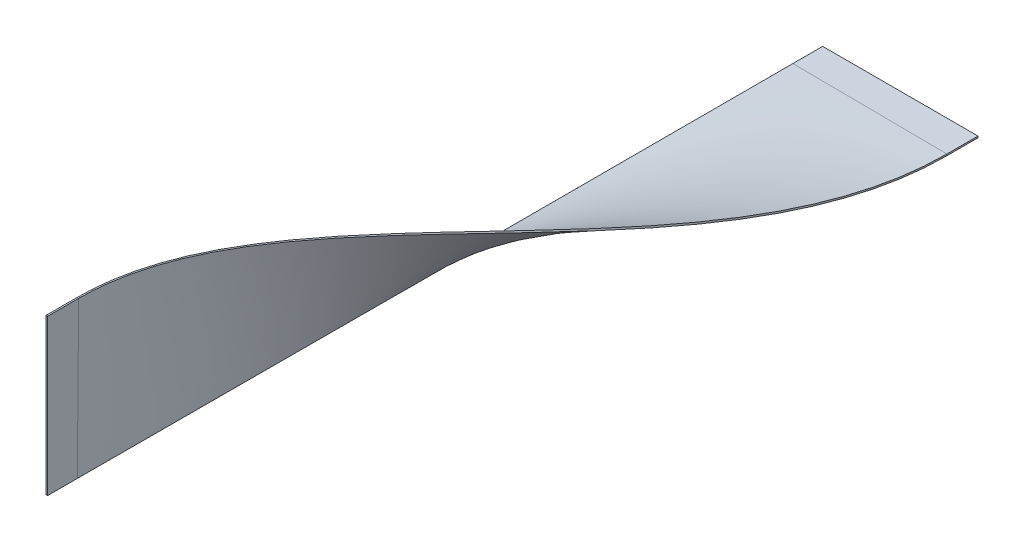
ISO-10303-21;
HEADER;
FILE_DESCRIPTION(('STEP AP214'),'2;1');
FILE_NAME('part.step','',(''),(''),'','','');
FILE_SCHEMA(('AUTOMOTIVE_DESIGN { 1 0 10303 214 1 1 1 1 }'));
ENDSEC;
DATA;
#1=APPLICATION_CONTEXT('core data for automotive mechanical design processes');
#2=APPLICATION_PROTOCOL_DEFINITION('international standard','automotive_design',2000,#1);
#3=PRODUCT_CONTEXT('',#1,'mechanical');
#4=PRODUCT('Part','Part','',(#3));
#5=PRODUCT_RELATED_PRODUCT_CATEGORY('part','',(#4));
#6=PRODUCT_DEFINITION_FORMATION('','',#4);
#7=PRODUCT_DEFINITION_CONTEXT('part definition',#1,'design');
#8=PRODUCT_DEFINITION('design','',#6,#7);
#9=PRODUCT_DEFINITION_SHAPE('','',#8);
#10=(LENGTH_UNIT() NAMED_UNIT(*) SI_UNIT(.MILLI.,.METRE.));
#11=(NAMED_UNIT(*) PLANE_ANGLE_UNIT() SI_UNIT($,.RADIAN.));
#12=(NAMED_UNIT(*) SI_UNIT($,.STERADIAN.) SOLID_ANGLE_UNIT());
#13=UNCERTAINTY_MEASURE_WITH_UNIT(LENGTH_MEASURE(1.E-05),#10,'distance_accuracy_value','');
#14=(GEOMETRIC_REPRESENTATION_CONTEXT(3) GLOBAL_UNCERTAINTY_ASSIGNED_CONTEXT((#13)) GLOBAL_UNIT_ASSIGNED_CONTEXT((#10,
#11,#12)) REPRESENTATION_CONTEXT('',''));
#15=CARTESIAN_POINT('',(0.,0.,0.));
#16=DIRECTION('',(0.,0.,1.));
#17=DIRECTION('',(1.,0.,0.));
#18=AXIS2_PLACEMENT_3D('',#15,#16,#17);
#19=CARTESIAN_POINT('',(0.,0.,0.));
#20=DIRECTION('',(0.,-1.,0.));
#21=DIRECTION('',(0.,0.,1.));
#22=AXIS2_PLACEMENT_3D('',#19,#20,#21);
#23=PLANE('',#22);
#24=DIRECTION('',(1.,0.,0.));
#25=VECTOR('',#24,1.);
#26=CARTESIAN_POINT('',(0.,0.,500.));
#27=LINE('',#26,#25);
#28=CARTESIAN_POINT('',(0.,0.,500.));
#29=VERTEX_POINT('',#28);
#30=CARTESIAN_POINT('',(1.00000000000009,0.,500.));
#31=VERTEX_POINT('',#30);
#32=EDGE_CURVE('E14',#29,#31,#27,.T.);
#33=ORIENTED_EDGE('',*,*,#32,.F.);
#34=DIRECTION('',(0.,0.,1.));
#35=VECTOR('',#34,1.);
#36=CARTESIAN_POINT('',(0.,0.,0.));
#37=LINE('',#36,#35);
#38=CARTESIAN_POINT('',(0.,0.,480.815287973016));
#39=VERTEX_POINT('',#38);
#40=EDGE_CURVE('E391',#39,#29,#37,.T.);
#41=ORIENTED_EDGE('',*,*,#40,.F.);
#42=CARTESIAN_POINT('',(1.00000000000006,0.,480.815287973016));
#43=CARTESIAN_POINT('',(0.,0.,480.815287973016));
#44=B_SPLINE_CURVE_WITH_KNOTS('',1,(#42,#43),.UNSPECIFIED.,.F.,.F.,(2,2),(0.,1.),.UNSPECIFIED.);
#45=CARTESIAN_POINT('',(1.00000000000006,0.,480.815287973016));
#46=VERTEX_POINT('',#45);
#47=EDGE_CURVE('E69',#39,#46,#44,.F.);
#48=ORIENTED_EDGE('',*,*,#47,.T.);
#49=DIRECTION('',(0.,0.,1.));
#50=VECTOR('',#49,1.);
#51=CARTESIAN_POINT('',(1.00000000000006,0.,480.));
#52=LINE('',#51,#50);
#53=EDGE_CURVE('E382',#46,#31,#52,.T.);
#54=ORIENTED_EDGE('',*,*,#53,.T.);
#55=EDGE_LOOP('',(#33,#41,#48,#54));
#56=FACE_BOUND('',#55,.T.);
#57=ADVANCED_FACE('F59',(#56),#23,.T.);
#58=CARTESIAN_POINT('',(1.00000000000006,0.,480.815287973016));
#59=CARTESIAN_POINT('',(1.00000000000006,0.,461.580680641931));
#60=CARTESIAN_POINT('',(1.00032995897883,-0.0150885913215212,442.346073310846));
#61=CARTESIAN_POINT('',(0.997657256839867,-0.0746169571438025,403.876858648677));
#62=CARTESIAN_POINT('',(0.994873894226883,-0.119493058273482,384.642251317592));
#63=CARTESIAN_POINT('',(0.971690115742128,-0.244685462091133,346.173036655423));
#64=CARTESIAN_POINT('',(0.950879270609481,-0.32633143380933,326.938429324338));
#65=CARTESIAN_POINT('',(0.885815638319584,-0.466901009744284,298.086518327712));
#66=CARTESIAN_POINT('',(0.858393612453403,-0.516425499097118,288.469214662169));
#67=CARTESIAN_POINT('',(0.791154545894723,-0.614499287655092,269.234607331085));
#68=CARTESIAN_POINT('',(0.751300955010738,-0.662912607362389,259.617303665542));
#69=CARTESIAN_POINT('',(0.662912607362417,-0.751300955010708,240.382696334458));
#70=CARTESIAN_POINT('',(0.614499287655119,-0.791154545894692,230.765392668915));
#71=CARTESIAN_POINT('',(0.516425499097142,-0.858393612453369,211.530785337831));
#72=CARTESIAN_POINT('',(0.466901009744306,-0.885815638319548,201.913481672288));
#73=CARTESIAN_POINT('',(0.326331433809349,-0.950879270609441,173.061570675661));
#74=CARTESIAN_POINT('',(0.24468546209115,-0.971690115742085,153.826963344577));
#75=CARTESIAN_POINT('',(0.119493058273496,-0.994873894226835,115.357748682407));
#76=CARTESIAN_POINT('',(0.0746169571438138,-0.997657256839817,96.1231413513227));
#77=CARTESIAN_POINT('',(0.0150885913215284,-1.00032995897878,57.6539266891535));
#78=CARTESIAN_POINT('',(0.,-1.,38.4193193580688));
#79=CARTESIAN_POINT('',(0.,-1.,19.1847120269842));
#80=CARTESIAN_POINT('',(0.,0.,480.815287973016));
#81=CARTESIAN_POINT('',(0.,0.,461.580680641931));
#82=CARTESIAN_POINT('',(0.,0.,442.346073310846));
#83=CARTESIAN_POINT('',(0.,0.,403.876858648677));
#84=CARTESIAN_POINT('',(0.,0.,384.642251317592));
#85=CARTESIAN_POINT('',(0.,0.,346.173036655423));
#86=CARTESIAN_POINT('',(0.,0.,326.938429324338));
#87=CARTESIAN_POINT('',(0.,0.,298.086518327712));
#88=CARTESIAN_POINT('',(0.,0.,288.469214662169));
#89=CARTESIAN_POINT('',(0.,0.,269.234607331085));
#90=CARTESIAN_POINT('',(0.,0.,259.617303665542));
#91=CARTESIAN_POINT('',(0.,0.,240.382696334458));
#92=CARTESIAN_POINT('',(0.,0.,230.765392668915));
#93=CARTESIAN_POINT('',(0.,0.,211.530785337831));
#94=CARTESIAN_POINT('',(0.,0.,201.913481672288));
#95=CARTESIAN_POINT('',(0.,0.,173.061570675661));
#96=CARTESIAN_POINT('',(0.,0.,153.826963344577));
#97=CARTESIAN_POINT('',(0.,0.,115.357748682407));
#98=CARTESIAN_POINT('',(0.,0.,96.1231413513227));
#99=CARTESIAN_POINT('',(0.,0.,57.6539266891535));
#100=CARTESIAN_POINT('',(0.,0.,38.4193193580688));
#101=CARTESIAN_POINT('',(0.,0.,19.1847120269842));
#102=B_SPLINE_SURFACE_WITH_KNOTS('',1,3,((#58,#59,#60,#61,#62,#63,#64,#65,#66,#67,#68,#69,#70,
#71,#72,#73,#74,#75,#76,#77,#78,#79),(#80,#81,#82,#83,#84,#85,#86,#87,#88,#89,#90,#91,#92,#93,
#94,#95,#96,#97,#98,#99,#100,#101)),.UNSPECIFIED.,.F.,.F.,.F.,(2,2),(4,2,2,2,2,2,2,2,2,2,4),(0.,
1.),(-0.230815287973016,-0.173111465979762,-0.115407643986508,-0.0577038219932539,
-0.028851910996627,0.,0.028851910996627,0.0577038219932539,0.115407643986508,0.173111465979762,
0.230815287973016),.UNSPECIFIED.);
#103=CARTESIAN_POINT('',(0.,0.,480.815287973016));
#104=CARTESIAN_POINT('',(0.,0.,461.580680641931));
#105=CARTESIAN_POINT('',(0.,0.,442.346073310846));
#106=CARTESIAN_POINT('',(0.,0.,403.876858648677));
#107=CARTESIAN_POINT('',(0.,0.,384.642251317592));
#108=CARTESIAN_POINT('',(0.,0.,346.173036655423));
#109=CARTESIAN_POINT('',(0.,0.,326.938429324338));
#110=CARTESIAN_POINT('',(0.,0.,298.086518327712));
#111=CARTESIAN_POINT('',(0.,0.,288.469214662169));
#112=CARTESIAN_POINT('',(0.,0.,269.234607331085));
#113=CARTESIAN_POINT('',(0.,0.,259.617303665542));
#114=CARTESIAN_POINT('',(0.,0.,240.382696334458));
#115=CARTESIAN_POINT('',(0.,0.,230.765392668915));
#116=CARTESIAN_POINT('',(0.,0.,211.530785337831));
#117=CARTESIAN_POINT('',(0.,0.,201.913481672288));
#118=CARTESIAN_POINT('',(0.,0.,173.061570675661));
#119=CARTESIAN_POINT('',(0.,0.,153.826963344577));
#120=CARTESIAN_POINT('',(0.,0.,115.357748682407));
#121=CARTESIAN_POINT('',(0.,0.,96.1231413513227));
#122=CARTESIAN_POINT('',(0.,0.,57.6539266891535));
#123=CARTESIAN_POINT('',(0.,0.,38.4193193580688));
#124=CARTESIAN_POINT('',(0.,0.,19.1847120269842));
#125=B_SPLINE_CURVE_WITH_KNOTS('',3,(#103,#104,#105,#106,#107,#108,#109,#110,#111,#112,#113,
#114,#115,#116,#117,#118,#119,#120,#121,#122,#123,#124),.UNSPECIFIED.,.F.,.F.,(4,2,2,2,2,2,2,2,
2,2,4),(-0.230815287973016,-0.173111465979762,-0.115407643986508,-0.0577038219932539,
-0.028851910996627,0.,0.028851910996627,0.0577038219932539,0.115407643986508,0.173111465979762,
0.230815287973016),.UNSPECIFIED.);
#126=CARTESIAN_POINT('',(0.,0.,19.1847120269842));
#127=VERTEX_POINT('',#126);
#128=EDGE_CURVE('E158',#39,#127,#125,.T.);
#129=CARTESIAN_POINT('',(0.,0.,19.1847120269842));
#130=CARTESIAN_POINT('',(0.,-1.,19.1847120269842));
#131=B_SPLINE_CURVE_WITH_KNOTS('',1,(#129,#130),.UNSPECIFIED.,.F.,.F.,(2,2),(0.,1.),.UNSPECIFIED.);
#132=CARTESIAN_POINT('',(0.,-1.,19.1847120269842));
#133=VERTEX_POINT('',#132);
#134=EDGE_CURVE('E303',#127,#133,#131,.T.);
#135=CARTESIAN_POINT('',(1.00000000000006,0.,480.815287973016));
#136=CARTESIAN_POINT('',(0.999911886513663,-0.000134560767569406,471.197983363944));
#137=CARTESIAN_POINT('',(0.999996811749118,-0.0039010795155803,461.580678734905));
#138=CARTESIAN_POINT('',(0.999874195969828,-0.0188135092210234,442.346069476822));
#139=CARTESIAN_POINT('',(0.999666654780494,-0.0299594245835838,432.728764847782));
#140=CARTESIAN_POINT('',(0.998320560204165,-0.0597461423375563,413.494155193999));
#141=CARTESIAN_POINT('',(0.997182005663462,-0.078386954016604,403.876850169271));
#142=CARTESIAN_POINT('',(0.992561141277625,-0.123905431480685,384.642239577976));
#143=CARTESIAN_POINT('',(0.989078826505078,-0.150783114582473,375.02493401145));
#144=CARTESIAN_POINT('',(0.977485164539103,-0.213395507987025,355.790322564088));
#145=CARTESIAN_POINT('',(0.969373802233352,-0.249130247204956,346.173016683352));
#146=CARTESIAN_POINT('',(0.945237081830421,-0.329026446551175,326.938405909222));
#147=CARTESIAN_POINT('',(0.92921168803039,-0.373187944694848,317.321101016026));
#148=CARTESIAN_POINT('',(0.885795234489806,-0.466901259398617,298.086494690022));
#149=CARTESIAN_POINT('',(0.858404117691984,-0.516453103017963,288.469193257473));
#150=CARTESIAN_POINT('',(0.791143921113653,-0.614471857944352,269.234594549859));
#151=CARTESIAN_POINT('',(0.751274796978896,-0.662938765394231,259.617297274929));
#152=CARTESIAN_POINT('',(0.662938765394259,-0.751274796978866,240.382702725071));
#153=CARTESIAN_POINT('',(0.614471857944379,-0.791143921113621,230.765405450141));
#154=CARTESIAN_POINT('',(0.516453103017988,-0.858404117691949,211.530806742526));
#155=CARTESIAN_POINT('',(0.46690125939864,-0.88579523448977,201.913505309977));
#156=CARTESIAN_POINT('',(0.373187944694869,-0.929211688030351,182.678898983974));
#157=CARTESIAN_POINT('',(0.329026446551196,-0.945237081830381,173.061594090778));
#158=CARTESIAN_POINT('',(0.249130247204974,-0.96937380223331,153.826983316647));
#159=CARTESIAN_POINT('',(0.213395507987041,-0.977485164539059,144.209677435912));
#160=CARTESIAN_POINT('',(0.150783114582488,-0.989078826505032,124.97506598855));
#161=CARTESIAN_POINT('',(0.123905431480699,-0.992561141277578,115.357760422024));
#162=CARTESIAN_POINT('',(0.0783869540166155,-0.997182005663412,96.1231498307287));
#163=CARTESIAN_POINT('',(0.0597461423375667,-0.998320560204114,86.5058448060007));
#164=CARTESIAN_POINT('',(0.0299594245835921,-0.999666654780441,67.2712351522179));
#165=CARTESIAN_POINT('',(0.0188135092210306,-0.999874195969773,57.6539305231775));
#166=CARTESIAN_POINT('',(0.00390107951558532,-0.999996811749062,38.4193212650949));
#167=CARTESIAN_POINT('',(0.000134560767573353,-0.999911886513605,28.8020166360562));
#168=CARTESIAN_POINT('',(0.,-1.,19.1847120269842));
#169=B_SPLINE_CURVE_WITH_KNOTS('',3,(#135,#136,#137,#138,#139,#140,#141,#142,#143,#144,#145,
#146,#147,#148,#149,#150,#151,#152,#153,#154,#155,#156,#157,#158,#159,#160,#161,#162,#163,#164,
#165,#166,#167,#168),.UNSPECIFIED.,.F.,.F.,(4,2,2,2,2,2,2,2,2,2,2,2,2,2,2,2,4),(0.,
28.8519132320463,57.7038436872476,86.5558098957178,115.407836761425,144.259957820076,
173.112209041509,201.964605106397,230.817103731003,259.66960235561,288.521998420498,
317.374249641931,346.226370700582,375.078397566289,403.930363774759,432.782294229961,
461.634207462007),.UNSPECIFIED.);
#170=EDGE_CURVE('E379',#46,#133,#169,.T.);
#171=ORIENTED_EDGE('',*,*,#47,.F.);
#172=ORIENTED_EDGE('',*,*,#128,.T.);
#173=ORIENTED_EDGE('',*,*,#134,.T.);
#174=ORIENTED_EDGE('',*,*,#170,.F.);
#175=EDGE_LOOP('',(#171,#172,#173,#174));
#176=FACE_BOUND('',#175,.T.);
#177=ADVANCED_FACE('F314',(#176),#102,.T.);
#178=CARTESIAN_POINT('',(0.,0.,0.));
#179=DIRECTION('',(-1.,0.,0.));
#180=DIRECTION('',(0.,0.,1.));
#181=AXIS2_PLACEMENT_3D('',#178,#179,#180);
#182=PLANE('',#181);
#183=ORIENTED_EDGE('',*,*,#134,.F.);
#184=DIRECTION('',(0.,0.,1.));
#185=VECTOR('',#184,1.);
#186=CARTESIAN_POINT('',(0.,0.,0.));
#187=LINE('',#186,#185);
#188=CARTESIAN_POINT('',(0.,0.,0.));
#189=VERTEX_POINT('',#188);
#190=EDGE_CURVE('E145',#189,#127,#187,.T.);
#191=ORIENTED_EDGE('',*,*,#190,.F.);
#192=DIRECTION('',(0.,-1.,0.));
#193=VECTOR('',#192,1.);
#194=CARTESIAN_POINT('',(0.,0.,0.));
#195=LINE('',#194,#193);
#196=CARTESIAN_POINT('',(0.,-1.,0.));
#197=VERTEX_POINT('',#196);
#198=EDGE_CURVE('E121',#189,#197,#195,.T.);
#199=ORIENTED_EDGE('',*,*,#198,.T.);
#200=DIRECTION('',(0.,0.,1.));
#201=VECTOR('',#200,1.);
#202=CARTESIAN_POINT('',(0.,-1.,0.));
#203=LINE('',#202,#201);
#204=EDGE_CURVE('E369',#197,#133,#203,.T.);
#205=ORIENTED_EDGE('',*,*,#204,.T.);
#206=EDGE_LOOP('',(#183,#191,#199,#205));
#207=FACE_BOUND('',#206,.T.);
#208=ADVANCED_FACE('F325',(#207),#182,.T.);
#209=CARTESIAN_POINT('',(0.,0.,0.));
#210=DIRECTION('',(0.,0.,1.));
#211=DIRECTION('',(1.,0.,0.));
#212=AXIS2_PLACEMENT_3D('',#209,#210,#211);
#213=PLANE('',#212);
#214=ORIENTED_EDGE('',*,*,#198,.F.);
#215=DIRECTION('',(1.,0.,0.));
#216=VECTOR('',#215,1.);
#217=CARTESIAN_POINT('',(0.,0.,0.));
#218=LINE('',#217,#216);
#219=CARTESIAN_POINT('',(100.,0.,0.));
#220=VERTEX_POINT('',#219);
#221=EDGE_CURVE('E140',#189,#220,#218,.T.);
#222=ORIENTED_EDGE('',*,*,#221,.T.);
#223=DIRECTION('',(0.,-1.,0.));
#224=VECTOR('',#223,1.);
#225=CARTESIAN_POINT('',(100.,0.,0.));
#226=LINE('',#225,#224);
#227=CARTESIAN_POINT('',(100.,-1.,0.));
#228=VERTEX_POINT('',#227);
#229=EDGE_CURVE('E127',#220,#228,#226,.T.);
#230=ORIENTED_EDGE('',*,*,#229,.T.);
#231=DIRECTION('',(1.,0.,0.));
#232=VECTOR('',#231,1.);
#233=CARTESIAN_POINT('',(100.,-1.,0.));
#234=LINE('',#233,#232);
#235=EDGE_CURVE('E399',#197,#228,#234,.T.);
#236=ORIENTED_EDGE('',*,*,#235,.F.);
#237=EDGE_LOOP('',(#214,#222,#230,#236));
#238=FACE_BOUND('',#237,.T.);
#239=ADVANCED_FACE('F147',(#238),#213,.F.);
#240=CARTESIAN_POINT('',(100.,0.,20.));
#241=DIRECTION('',(1.,0.,0.));
#242=DIRECTION('',(0.,0.,-1.));
#243=AXIS2_PLACEMENT_3D('',#240,#241,#242);
#244=PLANE('',#243);
#245=ORIENTED_EDGE('',*,*,#229,.F.);
#246=DIRECTION('',(0.,0.,-1.));
#247=VECTOR('',#246,1.);
#248=CARTESIAN_POINT('',(100.,0.,20.));
#249=LINE('',#248,#247);
#250=CARTESIAN_POINT('',(100.,0.,19.9999999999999));
#251=VERTEX_POINT('',#250);
#252=EDGE_CURVE('E130',#251,#220,#249,.T.);
#253=ORIENTED_EDGE('',*,*,#252,.F.);
#254=CARTESIAN_POINT('',(100.,-1.,19.9999999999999));
#255=CARTESIAN_POINT('',(100.,0.,19.9999999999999));
#256=B_SPLINE_CURVE_WITH_KNOTS('',1,(#254,#255),.UNSPECIFIED.,.F.,.F.,(2,2),(0.,1.),.UNSPECIFIED.);
#257=CARTESIAN_POINT('',(100.,-1.,19.9999999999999));
#258=VERTEX_POINT('',#257);
#259=EDGE_CURVE('E134',#251,#258,#256,.F.);
#260=ORIENTED_EDGE('',*,*,#259,.T.);
#261=DIRECTION('',(0.,0.,1.));
#262=VECTOR('',#261,1.);
#263=CARTESIAN_POINT('',(100.,-1.,0.));
#264=LINE('',#263,#262);
#265=EDGE_CURVE('E132',#258,#228,#264,.F.);
#266=ORIENTED_EDGE('',*,*,#265,.T.);
#267=EDGE_LOOP('',(#245,#253,#260,#266));
#268=FACE_BOUND('',#267,.T.);
#269=ADVANCED_FACE('F129',(#268),#244,.T.);
#270=CARTESIAN_POINT('',(1.,100.,480.));
#271=CARTESIAN_POINT('',(1.,100.000491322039,462.774648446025));
#272=CARTESIAN_POINT('',(2.5578949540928,98.4199449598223,445.079010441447));
#273=CARTESIAN_POINT('',(8.00865729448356,92.8855184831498,408.927441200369));
#274=CARTESIAN_POINT('',(11.901233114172,88.9310042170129,390.471685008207));
#275=CARTESIAN_POINT('',(21.227425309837,79.4306785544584,352.968919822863));
#276=CARTESIAN_POINT('',(26.6602985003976,73.88413121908,333.921779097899));
#277=CARTESIAN_POINT('',(38.2724961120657,61.9974676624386,295.392790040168));
#278=CARTESIAN_POINT('',(44.450971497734,55.6583401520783,275.909993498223));
#279=CARTESIAN_POINT('',(56.7893846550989,43.00475728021,236.669262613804));
#280=CARTESIAN_POINT('',(62.9510728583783,36.6914850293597,216.911607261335));
#281=CARTESIAN_POINT('',(74.5112481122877,24.8811608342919,177.302871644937));
#282=CARTESIAN_POINT('',(79.9100180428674,19.3829578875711,157.452532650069));
#283=CARTESIAN_POINT('',(89.1742208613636,9.96762542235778,117.839271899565));
#284=CARTESIAN_POINT('',(93.0389666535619,6.05005934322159,98.0763036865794));
#285=CARTESIAN_POINT('',(98.4518272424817,0.566309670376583,58.8062878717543));
#286=CARTESIAN_POINT('',(99.9995587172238,-1.00000000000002,39.2990744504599));
#287=CARTESIAN_POINT('',(100.,-1.,19.9999999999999));
#288=CARTESIAN_POINT('',(0.,100.,480.));
#289=CARTESIAN_POINT('',(0.,100.,462.714609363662));
#290=CARTESIAN_POINT('',(1.5625,98.4375,444.968701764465));
#291=CARTESIAN_POINT('',(7.03125000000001,92.96875,408.724870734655));
#292=CARTESIAN_POINT('',(10.9375,89.0625,390.226947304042));
#293=CARTESIAN_POINT('',(20.3125,79.6875,352.6481027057));
#294=CARTESIAN_POINT('',(25.78125,74.21875,333.56718153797));
#295=CARTESIAN_POINT('',(37.5000000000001,62.5,294.991359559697));
#296=CARTESIAN_POINT('',(43.7500000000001,56.25,275.496458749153));
#297=CARTESIAN_POINT('',(56.2500000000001,43.75,236.26169557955));
#298=CARTESIAN_POINT('',(62.5000000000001,37.4999999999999,216.521833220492));
#299=CARTESIAN_POINT('',(74.2187500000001,25.7812499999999,176.96616504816));
#300=CARTESIAN_POINT('',(79.6875000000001,20.3124999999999,157.150359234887));
#301=CARTESIAN_POINT('',(89.0625000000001,10.9374999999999,117.611822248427));
#302=CARTESIAN_POINT('',(92.9687500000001,7.03124999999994,97.889091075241));
#303=CARTESIAN_POINT('',(98.4375,1.56249999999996,58.7057214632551));
#304=CARTESIAN_POINT('',(100.,0.,39.2450830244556));
#305=CARTESIAN_POINT('',(100.,0.,19.9999999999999));
#306=B_SPLINE_SURFACE_WITH_KNOTS('',1,3,((#270,#271,#272,#273,#274,#275,#276,#277,#278,#279,
#280,#281,#282,#283,#284,#285,#286,#287),(#288,#289,#290,#291,#292,#293,#294,#295,#296,#297,
#298,#299,#300,#301,#302,#303,#304,#305)),.UNSPECIFIED.,.F.,.F.,.F.,(2,2),(4,2,2,2,2,2,2,2,4),
(0.,1.),(0.,0.125,0.25,0.375,0.5,0.625,0.75,0.875,1.),.UNSPECIFIED.);
#307=CARTESIAN_POINT('',(100.,0.,19.9999999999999));
#308=CARTESIAN_POINT('',(100.,0.,39.2450830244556));
#309=CARTESIAN_POINT('',(98.4375,1.56249999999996,58.7057214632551));
#310=CARTESIAN_POINT('',(92.9687500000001,7.03124999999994,97.889091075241));
#311=CARTESIAN_POINT('',(89.0625000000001,10.9374999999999,117.611822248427));
#312=CARTESIAN_POINT('',(79.6875000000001,20.3124999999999,157.150359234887));
#313=CARTESIAN_POINT('',(74.2187500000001,25.7812499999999,176.96616504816));
#314=CARTESIAN_POINT('',(62.5000000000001,37.4999999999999,216.521833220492));
#315=CARTESIAN_POINT('',(56.2500000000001,43.75,236.26169557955));
#316=CARTESIAN_POINT('',(43.7500000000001,56.25,275.496458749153));
#317=CARTESIAN_POINT('',(37.5000000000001,62.5,294.991359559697));
#318=CARTESIAN_POINT('',(25.78125,74.21875,333.56718153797));
#319=CARTESIAN_POINT('',(20.3125,79.6875,352.6481027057));
#320=CARTESIAN_POINT('',(10.9375,89.0625,390.226947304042));
#321=CARTESIAN_POINT('',(7.03125000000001,92.96875,408.724870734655));
#322=CARTESIAN_POINT('',(1.5625,98.4375,444.968701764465));
#323=CARTESIAN_POINT('',(0.,100.,462.714609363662));
#324=CARTESIAN_POINT('',(0.,100.,480.));
#325=B_SPLINE_CURVE_WITH_KNOTS('',3,(#307,#308,#309,#310,#311,#312,#313,#314,#315,#316,#317,
#318,#319,#320,#321,#322,#323,#324),.UNSPECIFIED.,.F.,.F.,(4,2,2,2,2,2,2,2,4),(0.,0.125,0.25,
0.375,0.5,0.625,0.75,0.875,1.),.UNSPECIFIED.);
#326=CARTESIAN_POINT('',(0.,100.,480.));
#327=VERTEX_POINT('',#326);
#328=EDGE_CURVE('E211',#251,#327,#325,.T.);
#329=CARTESIAN_POINT('',(0.,100.,480.));
#330=CARTESIAN_POINT('',(1.,100.,480.));
#331=B_SPLINE_CURVE_WITH_KNOTS('',1,(#329,#330),.UNSPECIFIED.,.F.,.F.,(2,2),(0.,1.),.UNSPECIFIED.);
#332=CARTESIAN_POINT('',(1.,100.,480.));
#333=VERTEX_POINT('',#332);
#334=EDGE_CURVE('E77',#327,#333,#331,.T.);
#335=CARTESIAN_POINT('',(100.,-1.,19.9999999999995));
#336=CARTESIAN_POINT('',(100.000017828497,-1.00011010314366,24.840559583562));
#337=CARTESIAN_POINT('',(99.9024703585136,-0.901429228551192,29.6797683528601));
#338=CARTESIAN_POINT('',(99.5274250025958,-0.521834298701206,39.3818244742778));
#339=CARTESIAN_POINT('',(99.2485401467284,-0.239515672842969,44.2445648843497));
#340=CARTESIAN_POINT('',(98.5230940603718,0.494950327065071,53.9905982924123));
#341=CARTESIAN_POINT('',(98.0749726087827,0.948677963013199,58.8736510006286));
#342=CARTESIAN_POINT('',(97.0233768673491,2.01362476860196,68.6581772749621));
#343=CARTESIAN_POINT('',(96.4183131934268,2.62645526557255,73.5593015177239));
#344=CARTESIAN_POINT('',(95.0650066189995,3.99748571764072,83.3775143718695));
#345=CARTESIAN_POINT('',(94.3152480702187,4.75722468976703,88.2941756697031));
#346=CARTESIAN_POINT('',(92.6846667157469,6.41006943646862,98.1410056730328));
#347=CARTESIAN_POINT('',(91.8024706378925,7.30457300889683,103.070709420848));
#348=CARTESIAN_POINT('',(89.9190767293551,9.21504194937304,112.941071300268));
#349=CARTESIAN_POINT('',(88.916687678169,10.2322238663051,117.881264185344));
#350=CARTESIAN_POINT('',(86.8049313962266,12.3762131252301,127.769976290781));
#351=CARTESIAN_POINT('',(85.6945722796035,13.5040379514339,132.718061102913));
#352=CARTESIAN_POINT('',(83.378879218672,15.8575087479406,142.619869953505));
#353=CARTESIAN_POINT('',(82.1727535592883,17.0839715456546,147.573213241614));
#354=CARTESIAN_POINT('',(79.6774440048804,19.6229742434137,157.48272849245));
#355=CARTESIAN_POINT('',(78.387657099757,20.9361406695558,162.438586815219));
#356=CARTESIAN_POINT('',(74.3998948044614,24.9990165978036,177.350885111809));
#357=CARTESIAN_POINT('',(71.6067868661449,27.8484669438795,187.254661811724));
#358=CARTESIAN_POINT('',(65.8324934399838,33.7477181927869,207.038759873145));
#359=CARTESIAN_POINT('',(62.8499803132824,36.7989414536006,216.918257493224));
#360=CARTESIAN_POINT('',(56.7886758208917,43.0065497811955,236.630857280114));
#361=CARTESIAN_POINT('',(53.709753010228,46.1630788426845,246.463873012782));
#362=CARTESIAN_POINT('',(47.5476537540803,52.4825325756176,266.061157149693));
#363=CARTESIAN_POINT('',(44.4645945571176,55.645325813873,275.825505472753));
#364=CARTESIAN_POINT('',(39.8919395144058,60.3338064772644,290.455875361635));
#365=CARTESIAN_POINT('',(38.3828230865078,61.8807459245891,295.308920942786));
#366=CARTESIAN_POINT('',(35.3992956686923,64.937756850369,304.990372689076));
#367=CARTESIAN_POINT('',(33.9247026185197,66.4480254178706,309.81866023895));
#368=CARTESIAN_POINT('',(31.0224554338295,69.41887052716,319.448251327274));
#369=CARTESIAN_POINT('',(29.5944820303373,70.8797899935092,324.249352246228));
#370=CARTESIAN_POINT('',(26.7979149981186,73.7391295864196,333.822275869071));
#371=CARTESIAN_POINT('',(25.4288257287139,75.1380770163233,338.593795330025));
#372=CARTESIAN_POINT('',(22.7625903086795,77.8607427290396,348.105262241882));
#373=CARTESIAN_POINT('',(21.4647327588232,79.185210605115,352.844794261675));
#374=CARTESIAN_POINT('',(18.9536195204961,81.7462510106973,362.289972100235));
#375=CARTESIAN_POINT('',(17.7393978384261,82.983832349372,366.995085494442));
#376=CARTESIAN_POINT('',(15.4082715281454,85.3584845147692,376.369072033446));
#377=CARTESIAN_POINT('',(14.2901102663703,86.4968575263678,381.037299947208));
#378=CARTESIAN_POINT('',(12.1638486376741,88.6605075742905,390.335107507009));
#379=CARTESIAN_POINT('',(11.1541708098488,89.6874087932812,394.963944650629));
#380=CARTESIAN_POINT('',(9.25762489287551,91.6155413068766,404.180499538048));
#381=CARTESIAN_POINT('',(8.36883886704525,92.5187373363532,408.767406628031));
#382=CARTESIAN_POINT('',(6.72680918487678,94.1868842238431,417.897543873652));
#383=CARTESIAN_POINT('',(5.9713047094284,94.9541421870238,422.43993982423));
#384=CARTESIAN_POINT('',(4.6085275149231,96.3378374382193,431.478433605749));
#385=CARTESIAN_POINT('',(3.99867516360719,96.9568999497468,435.973732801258));
#386=CARTESIAN_POINT('',(2.93981980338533,98.031628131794,444.915193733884));
#387=CARTESIAN_POINT('',(2.48798046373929,98.4901752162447,449.360665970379));
#388=CARTESIAN_POINT('',(1.75762527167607,99.2313592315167,458.199898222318));
#389=CARTESIAN_POINT('',(1.47613054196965,99.5170195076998,462.593144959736));
#390=CARTESIAN_POINT('',(1.0988053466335,99.8998760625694,471.323797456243));
#391=CARTESIAN_POINT('',(1.00003084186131,100.000060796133,475.66094988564));
#392=CARTESIAN_POINT('',(1.,100.,479.999999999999));
#393=B_SPLINE_CURVE_WITH_KNOTS('',3,(#335,#336,#337,#338,#339,#340,#341,#342,#343,#344,#345,
#346,#347,#348,#349,#350,#351,#352,#353,#354,#355,#356,#357,#358,#359,#360,#361,#362,#363,#364,
#365,#366,#367,#368,#369,#370,#371,#372,#373,#374,#375,#376,#377,#378,#379,#380,#381,#382,#383,
#384,#385,#386,#387,#388,#389,#390,#391,#392),.UNSPECIFIED.,.F.,.F.,(4,2,2,2,2,2,2,2,2,2,2,2,2,
2,2,2,2,2,2,2,2,2,2,2,2,2,2,2,4),(0.,14.5177301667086,29.1478273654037,43.9162316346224,
58.8404717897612,73.9304755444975,89.1894084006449,104.614497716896,120.197814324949,
135.926996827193,151.78591310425,183.812171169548,216.095036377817,248.424016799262,
280.574581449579,296.511955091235,312.320299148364,327.972940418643,343.444615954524,
358.711935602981,373.753903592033,388.55251388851,403.093433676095,417.366787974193,
431.368055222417,445.099077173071,458.569174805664,471.796343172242,484.808470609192),.UNSPECIFIED.);
#394=EDGE_CURVE('E227',#258,#333,#393,.T.);
#395=ORIENTED_EDGE('',*,*,#259,.F.);
#396=ORIENTED_EDGE('',*,*,#328,.T.);
#397=ORIENTED_EDGE('',*,*,#334,.T.);
#398=ORIENTED_EDGE('',*,*,#394,.F.);
#399=EDGE_LOOP('',(#395,#396,#397,#398));
#400=FACE_BOUND('',#399,.T.);
#401=ADVANCED_FACE('F234',(#400),#306,.F.);
#402=CARTESIAN_POINT('',(0.,100.,500.));
#403=DIRECTION('',(0.,1.,0.));
#404=DIRECTION('',(0.,0.,-1.));
#405=AXIS2_PLACEMENT_3D('',#402,#403,#404);
#406=PLANE('',#405);
#407=ORIENTED_EDGE('',*,*,#334,.F.);
#408=DIRECTION('',(0.,0.,-1.));
#409=VECTOR('',#408,1.);
#410=CARTESIAN_POINT('',(0.,100.,500.));
#411=LINE('',#410,#409);
#412=CARTESIAN_POINT('',(0.,100.,500.));
#413=VERTEX_POINT('',#412);
#414=EDGE_CURVE('E157',#413,#327,#411,.T.);
#415=ORIENTED_EDGE('',*,*,#414,.F.);
#416=DIRECTION('',(1.,0.,0.));
#417=VECTOR('',#416,1.);
#418=CARTESIAN_POINT('',(0.,100.,500.));
#419=LINE('',#418,#417);
#420=CARTESIAN_POINT('',(1.00000000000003,100.,500.));
#421=VERTEX_POINT('',#420);
#422=EDGE_CURVE('E63',#413,#421,#419,.T.);
#423=ORIENTED_EDGE('',*,*,#422,.T.);
#424=DIRECTION('',(0.,0.,1.));
#425=VECTOR('',#424,1.);
#426=CARTESIAN_POINT('',(1.,100.,480.));
#427=LINE('',#426,#425);
#428=EDGE_CURVE('E169',#421,#333,#427,.F.);
#429=ORIENTED_EDGE('',*,*,#428,.T.);
#430=EDGE_LOOP('',(#407,#415,#423,#429));
#431=FACE_BOUND('',#430,.T.);
#432=ADVANCED_FACE('F246',(#431),#406,.T.);
#433=CARTESIAN_POINT('',(0.,0.,500.));
#434=DIRECTION('',(0.,0.,1.));
#435=DIRECTION('',(0.,1.,0.));
#436=AXIS2_PLACEMENT_3D('',#433,#434,#435);
#437=PLANE('',#436);
#438=DIRECTION('',(0.,1.,0.));
#439=VECTOR('',#438,1.);
#440=CARTESIAN_POINT('',(0.,0.,500.));
#441=LINE('',#440,#439);
#442=EDGE_CURVE('E151',#29,#413,#441,.T.);
#443=ORIENTED_EDGE('',*,*,#442,.F.);
#444=ORIENTED_EDGE('',*,*,#32,.T.);
#445=DIRECTION('',(0.,1.,0.));
#446=VECTOR('',#445,1.);
#447=CARTESIAN_POINT('',(1.00000000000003,100.,500.));
#448=LINE('',#447,#446);
#449=EDGE_CURVE('E385',#31,#421,#448,.T.);
#450=ORIENTED_EDGE('',*,*,#449,.T.);
#451=ORIENTED_EDGE('',*,*,#422,.F.);
#452=EDGE_LOOP('',(#443,#444,#450,#451));
#453=FACE_BOUND('',#452,.T.);
#454=ADVANCED_FACE('F61',(#453),#437,.T.);
#455=CARTESIAN_POINT('',(1.,100.,480.));
#456=DIRECTION('',(-1.,0.,0.));
#457=DIRECTION('',(0.,0.,1.));
#458=AXIS2_PLACEMENT_3D('',#455,#456,#457);
#459=PLANE('',#458);
#460=CARTESIAN_POINT('',(1.00000000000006,0.,480.815287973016));
#461=CARTESIAN_POINT('',(1.00000000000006,4.16666666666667,480.781317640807));
#462=CARTESIAN_POINT('',(1.00000000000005,8.33333333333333,480.747347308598));
#463=CARTESIAN_POINT('',(1.00000000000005,16.6666666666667,480.67940664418));
#464=CARTESIAN_POINT('',(1.00000000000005,20.8333333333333,480.645436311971));
#465=CARTESIAN_POINT('',(1.00000000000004,29.1666666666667,480.577495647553));
#466=CARTESIAN_POINT('',(1.00000000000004,33.3333333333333,480.543525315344));
#467=CARTESIAN_POINT('',(1.00000000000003,41.6666666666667,480.475584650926));
#468=CARTESIAN_POINT('',(1.00000000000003,45.8333333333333,480.441614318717));
#469=CARTESIAN_POINT('',(1.00000000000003,54.1666666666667,480.373673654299));
#470=CARTESIAN_POINT('',(1.00000000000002,58.3333333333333,480.33970332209));
#471=CARTESIAN_POINT('',(1.00000000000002,66.6666666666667,480.271762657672));
#472=CARTESIAN_POINT('',(1.00000000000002,70.8333333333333,480.237792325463));
#473=CARTESIAN_POINT('',(1.00000000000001,79.1666666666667,480.169851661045));
#474=CARTESIAN_POINT('',(1.00000000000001,83.3333333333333,480.135881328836));
#475=CARTESIAN_POINT('',(1.00000000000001,91.6666666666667,480.067940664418));
#476=CARTESIAN_POINT('',(1.,95.8333333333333,480.033970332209));
#477=CARTESIAN_POINT('',(1.,100.,479.999999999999));
#478=B_SPLINE_CURVE_WITH_KNOTS('',3,(#460,#461,#462,#463,#464,#465,#466,#467,#468,#469,#470,
#471,#472,#473,#474,#475,#476,#477),.UNSPECIFIED.,.F.,.F.,(4,2,2,2,2,2,2,2,4),(0.,
12.5004154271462,25.0008308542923,37.5012462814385,50.0016617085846,62.5020771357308,
75.0024925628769,87.5029079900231,100.003323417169),.UNSPECIFIED.);
#479=EDGE_CURVE('E402',#46,#333,#478,.T.);
#480=ORIENTED_EDGE('',*,*,#479,.T.);
#481=ORIENTED_EDGE('',*,*,#428,.F.);
#482=ORIENTED_EDGE('',*,*,#449,.F.);
#483=ORIENTED_EDGE('',*,*,#53,.F.);
#484=EDGE_LOOP('',(#480,#481,#482,#483));
#485=FACE_BOUND('',#484,.T.);
#486=ADVANCED_FACE('F182',(#485),#459,.F.);
#487=CARTESIAN_POINT('',(0.,0.,480.815287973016));
#488=CARTESIAN_POINT('',(0.,100.,480.));
#489=CARTESIAN_POINT('',(0.,0.,326.938429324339));
#490=CARTESIAN_POINT('',(0.,100.,341.716874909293));
#491=CARTESIAN_POINT('',(0.,0.,173.061570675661));
#492=CARTESIAN_POINT('',(100.,-1.86182217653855E-13,173.960664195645));
#493=CARTESIAN_POINT('',(0.,0.,19.1847120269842));
#494=CARTESIAN_POINT('',(100.,0.,19.9999999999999));
#495=B_SPLINE_SURFACE_WITH_KNOTS('',3,1,((#487,#488),(#489,#490),(#491,#492),(#493,#494)),
.UNSPECIFIED.,.F.,.F.,.F.,(4,4),(2,2),(0.,1.),(0.,1.),.UNSPECIFIED.);
#496=OFFSET_SURFACE('',#495,1.,.F.);
#497=ORIENTED_EDGE('',*,*,#170,.T.);
#498=CARTESIAN_POINT('',(0.,-1.,19.1847120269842));
#499=CARTESIAN_POINT('',(4.16666666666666,-1.,19.2186823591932));
#500=CARTESIAN_POINT('',(8.33333333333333,-1.,19.2526526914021));
#501=CARTESIAN_POINT('',(16.6666666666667,-1.,19.3205933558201));
#502=CARTESIAN_POINT('',(20.8333333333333,-1.,19.354563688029));
#503=CARTESIAN_POINT('',(29.1666666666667,-1.,19.422504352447));
#504=CARTESIAN_POINT('',(33.3333333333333,-1.,19.456474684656));
#505=CARTESIAN_POINT('',(41.6666666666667,-1.,19.5244153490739));
#506=CARTESIAN_POINT('',(45.8333333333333,-1.,19.5583856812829));
#507=CARTESIAN_POINT('',(54.1666666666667,-1.,19.6263263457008));
#508=CARTESIAN_POINT('',(58.3333333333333,-1.,19.6602966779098));
#509=CARTESIAN_POINT('',(66.6666666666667,-1.,19.7282373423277));
#510=CARTESIAN_POINT('',(70.8333333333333,-1.,19.7622076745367));
#511=CARTESIAN_POINT('',(79.1666666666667,-1.,19.8301483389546));
#512=CARTESIAN_POINT('',(83.3333333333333,-1.,19.8641186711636));
#513=CARTESIAN_POINT('',(91.6666666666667,-1.,19.9320593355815));
#514=CARTESIAN_POINT('',(95.8333333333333,-1.,19.9660296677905));
#515=CARTESIAN_POINT('',(100.,-1.,19.9999999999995));
#516=B_SPLINE_CURVE_WITH_KNOTS('',3,(#498,#499,#500,#501,#502,#503,#504,#505,#506,#507,#508,
#509,#510,#511,#512,#513,#514,#515),.UNSPECIFIED.,.F.,.F.,(4,2,2,2,2,2,2,2,4),(0.,
12.5004154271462,25.0008308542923,37.5012462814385,50.0016617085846,62.5020771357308,
75.0024925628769,87.5029079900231,100.003323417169),.UNSPECIFIED.);
#517=EDGE_CURVE('E202',#133,#258,#516,.T.);
#518=ORIENTED_EDGE('',*,*,#517,.T.);
#519=ORIENTED_EDGE('',*,*,#394,.T.);
#520=ORIENTED_EDGE('',*,*,#479,.F.);
#521=EDGE_LOOP('',(#497,#518,#519,#520));
#522=FACE_BOUND('',#521,.T.);
#523=ADVANCED_FACE('F172',(#522),#496,.T.);
#524=CARTESIAN_POINT('',(100.,-1.,0.));
#525=DIRECTION('',(0.,1.,0.));
#526=DIRECTION('',(0.,0.,1.));
#527=AXIS2_PLACEMENT_3D('',#524,#525,#526);
#528=PLANE('',#527);
#529=ORIENTED_EDGE('',*,*,#235,.T.);
#530=ORIENTED_EDGE('',*,*,#265,.F.);
#531=ORIENTED_EDGE('',*,*,#517,.F.);
#532=ORIENTED_EDGE('',*,*,#204,.F.);
#533=EDGE_LOOP('',(#529,#530,#531,#532));
#534=FACE_BOUND('',#533,.T.);
#535=ADVANCED_FACE('F181',(#534),#528,.F.);
#536=CARTESIAN_POINT('',(0.,100.,480.));
#537=DIRECTION('',(-1.,0.,0.));
#538=DIRECTION('',(0.,0.,1.));
#539=AXIS2_PLACEMENT_3D('',#536,#537,#538);
#540=PLANE('',#539);
#541=DIRECTION('',(0.,0.999966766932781,-0.00815260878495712));
#542=VECTOR('',#541,1.);
#543=CARTESIAN_POINT('',(0.,0.,480.815287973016));
#544=LINE('',#543,#542);
#545=EDGE_CURVE('E153',#39,#327,#544,.T.);
#546=ORIENTED_EDGE('',*,*,#545,.F.);
#547=ORIENTED_EDGE('',*,*,#40,.T.);
#548=ORIENTED_EDGE('',*,*,#442,.T.);
#549=ORIENTED_EDGE('',*,*,#414,.T.);
#550=EDGE_LOOP('',(#546,#547,#548,#549));
#551=FACE_BOUND('',#550,.T.);
#552=ADVANCED_FACE('F419',(#551),#540,.T.);
#553=CARTESIAN_POINT('',(0.,0.,480.815287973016));
#554=CARTESIAN_POINT('',(0.,100.,480.));
#555=CARTESIAN_POINT('',(0.,0.,326.938429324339));
#556=CARTESIAN_POINT('',(0.,100.,341.716874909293));
#557=CARTESIAN_POINT('',(0.,0.,173.061570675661));
#558=CARTESIAN_POINT('',(100.,-1.86182217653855E-13,173.960664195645));
#559=CARTESIAN_POINT('',(0.,0.,19.1847120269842));
#560=CARTESIAN_POINT('',(100.,0.,19.9999999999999));
#561=B_SPLINE_SURFACE_WITH_KNOTS('',3,1,((#553,#554),(#555,#556),(#557,#558),(#559,#560)),
.UNSPECIFIED.,.F.,.F.,.F.,(4,4),(2,2),(0.,1.),(0.,1.),.UNSPECIFIED.);
#562=DIRECTION('',(0.999966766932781,0.,0.00815260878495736));
#563=VECTOR('',#562,1.);
#564=CARTESIAN_POINT('',(50.,0.,19.5923560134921));
#565=LINE('',#564,#563);
#566=EDGE_CURVE('E143',#127,#251,#565,.T.);
#567=ORIENTED_EDGE('',*,*,#128,.F.);
#568=ORIENTED_EDGE('',*,*,#545,.T.);
#569=ORIENTED_EDGE('',*,*,#328,.F.);
#570=ORIENTED_EDGE('',*,*,#566,.F.);
#571=EDGE_LOOP('',(#567,#568,#569,#570));
#572=FACE_BOUND('',#571,.T.);
#573=ADVANCED_FACE('F184',(#572),#561,.F.);
#574=CARTESIAN_POINT('',(100.,0.,0.));
#575=DIRECTION('',(0.,1.,0.));
#576=DIRECTION('',(0.,0.,1.));
#577=AXIS2_PLACEMENT_3D('',#574,#575,#576);
#578=PLANE('',#577);
#579=ORIENTED_EDGE('',*,*,#221,.F.);
#580=ORIENTED_EDGE('',*,*,#190,.T.);
#581=ORIENTED_EDGE('',*,*,#566,.T.);
#582=ORIENTED_EDGE('',*,*,#252,.T.);
#583=EDGE_LOOP('',(#579,#580,#581,#582));
#584=FACE_BOUND('',#583,.T.);
#585=ADVANCED_FACE('F138',(#584),#578,.T.);
#586=CLOSED_SHELL('',(#57,#177,#208,#239,#269,#401,#432,#454,#486,#523,#535,#552,#573,#585));
#587=MANIFOLD_SOLID_BREP('B2',#586);
#588=ADVANCED_BREP_SHAPE_REPRESENTATION('',(#18,#587),#14);
#589=SHAPE_DEFINITION_REPRESENTATION(#9,#588);
ENDSEC;
END-ISO-10303-21;
